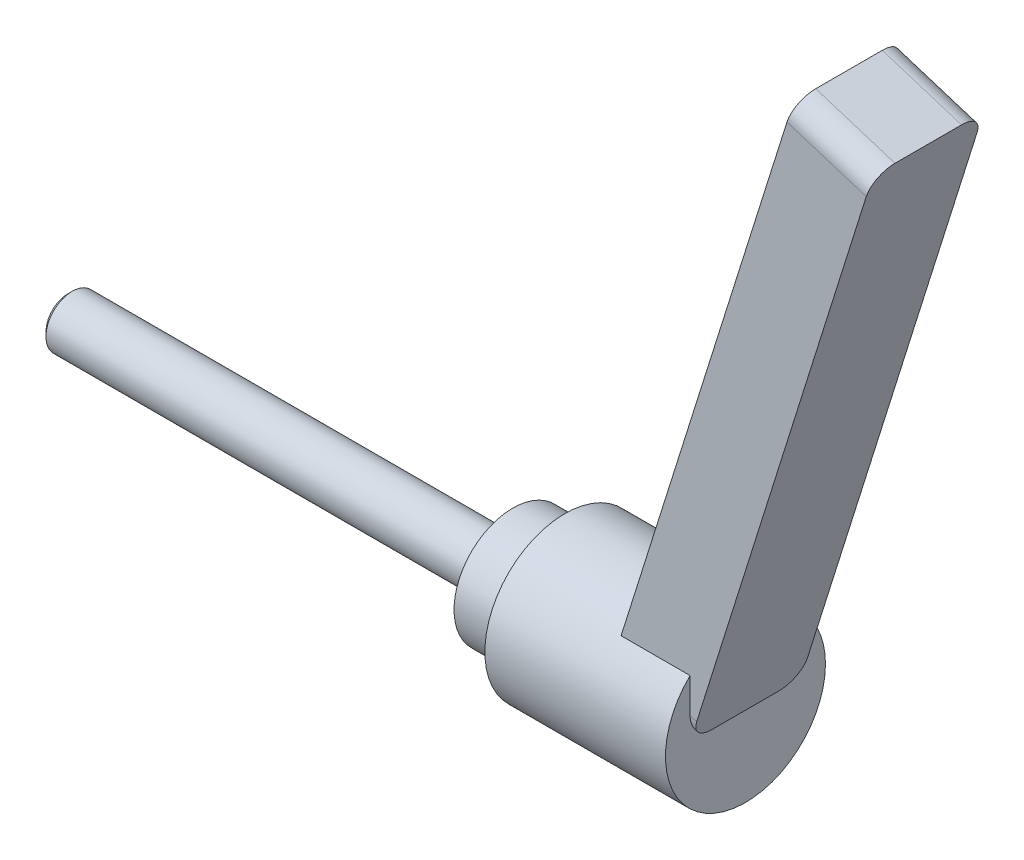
ISO-10303-21;
HEADER;
FILE_DESCRIPTION(('STEP AP214'),'2;1');
FILE_NAME('part.step','',(''),(''),'','','');
FILE_SCHEMA(('AUTOMOTIVE_DESIGN { 1 0 10303 214 1 1 1 1 }'));
ENDSEC;
DATA;
#1=APPLICATION_CONTEXT('core data for automotive mechanical design processes');
#2=APPLICATION_PROTOCOL_DEFINITION('international standard','automotive_design',2000,#1);
#3=PRODUCT_CONTEXT('',#1,'mechanical');
#4=PRODUCT('Part','Part','',(#3));
#5=PRODUCT_RELATED_PRODUCT_CATEGORY('part','',(#4));
#6=PRODUCT_DEFINITION_FORMATION('','',#4);
#7=PRODUCT_DEFINITION_CONTEXT('part definition',#1,'design');
#8=PRODUCT_DEFINITION('design','',#6,#7);
#9=PRODUCT_DEFINITION_SHAPE('','',#8);
#10=(LENGTH_UNIT() NAMED_UNIT(*) SI_UNIT(.MILLI.,.METRE.));
#11=(NAMED_UNIT(*) PLANE_ANGLE_UNIT() SI_UNIT($,.RADIAN.));
#12=(NAMED_UNIT(*) SI_UNIT($,.STERADIAN.) SOLID_ANGLE_UNIT());
#13=UNCERTAINTY_MEASURE_WITH_UNIT(LENGTH_MEASURE(1.E-05),#10,'distance_accuracy_value','');
#14=(GEOMETRIC_REPRESENTATION_CONTEXT(3) GLOBAL_UNCERTAINTY_ASSIGNED_CONTEXT((#13)) GLOBAL_UNIT_ASSIGNED_CONTEXT((#10,
#11,#12)) REPRESENTATION_CONTEXT('',''));
#15=CARTESIAN_POINT('',(0.,0.,0.));
#16=DIRECTION('',(0.,0.,1.));
#17=DIRECTION('',(1.,0.,0.));
#18=AXIS2_PLACEMENT_3D('',#15,#16,#17);
#19=CARTESIAN_POINT('',(-51.,0.,0.));
#20=DIRECTION('',(1.,0.,0.));
#21=DIRECTION('',(0.,0.,-1.));
#22=AXIS2_PLACEMENT_3D('',#19,#20,#21);
#23=PLANE('',#22);
#24=CARTESIAN_POINT('',(-51.0000000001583,0.,0.));
#25=DIRECTION('',(1.,0.,0.));
#26=DIRECTION('',(0.,0.,-1.));
#27=AXIS2_PLACEMENT_3D('',#24,#25,#26);
#28=CIRCLE('',#27,2.50000000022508);
#29=CARTESIAN_POINT('',(-51.0000000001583,0.,-2.5000000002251));
#30=VERTEX_POINT('',#29);
#31=EDGE_CURVE('E22',#30,#30,#28,.T.);
#32=ORIENTED_EDGE('',*,*,#31,.F.);
#33=EDGE_LOOP('',(#32));
#34=FACE_BOUND('',#33,.T.);
#35=ADVANCED_FACE('F19',(#34),#23,.F.);
#36=CARTESIAN_POINT('',(-50.4999999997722,0.,0.));
#37=DIRECTION('',(1.,0.,0.));
#38=DIRECTION('',(0.,0.,-1.));
#39=AXIS2_PLACEMENT_3D('',#36,#37,#38);
#40=CONICAL_SURFACE('',#39,2.99999999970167,0.785398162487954);
#41=CARTESIAN_POINT('',(-50.5,0.,0.));
#42=DIRECTION('',(-1.,0.,0.));
#43=DIRECTION('',(0.,0.,1.));
#44=AXIS2_PLACEMENT_3D('',#41,#42,#43);
#45=CIRCLE('',#44,3.);
#46=CARTESIAN_POINT('',(-50.5,0.,2.99999999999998));
#47=VERTEX_POINT('',#46);
#48=EDGE_CURVE('E140',#47,#47,#45,.F.);
#49=ORIENTED_EDGE('',*,*,#48,.F.);
#50=EDGE_LOOP('',(#49));
#51=FACE_BOUND('',#50,.T.);
#52=ORIENTED_EDGE('',*,*,#31,.T.);
#53=EDGE_LOOP('',(#52));
#54=FACE_BOUND('',#53,.T.);
#55=ADVANCED_FACE('F235',(#51,#54),#40,.T.);
#56=CARTESIAN_POINT('',(0.,0.,0.));
#57=DIRECTION('',(-1.,0.,0.));
#58=DIRECTION('',(0.,0.,1.));
#59=AXIS2_PLACEMENT_3D('',#56,#57,#58);
#60=CYLINDRICAL_SURFACE('',#59,3.);
#61=ORIENTED_EDGE('',*,*,#48,.T.);
#62=EDGE_LOOP('',(#61));
#63=FACE_BOUND('',#62,.T.);
#64=CARTESIAN_POINT('',(0.,0.,0.));
#65=DIRECTION('',(-1.,0.,0.));
#66=DIRECTION('',(0.,0.,1.));
#67=AXIS2_PLACEMENT_3D('',#64,#65,#66);
#68=CIRCLE('',#67,3.);
#69=CARTESIAN_POINT('',(0.,0.,3.));
#70=VERTEX_POINT('',#69);
#71=EDGE_CURVE('E143',#70,#70,#68,.T.);
#72=ORIENTED_EDGE('',*,*,#71,.T.);
#73=EDGE_LOOP('',(#72));
#74=FACE_BOUND('',#73,.T.);
#75=ADVANCED_FACE('F172',(#63,#74),#60,.T.);
#76=CARTESIAN_POINT('',(0.,0.,0.));
#77=DIRECTION('',(1.,0.,0.));
#78=DIRECTION('',(0.,0.,-1.));
#79=AXIS2_PLACEMENT_3D('',#76,#77,#78);
#80=PLANE('',#79);
#81=ORIENTED_EDGE('',*,*,#71,.F.);
#82=EDGE_LOOP('',(#81));
#83=FACE_BOUND('',#82,.T.);
#84=CARTESIAN_POINT('',(0.,0.,0.));
#85=DIRECTION('',(1.,0.,0.));
#86=DIRECTION('',(0.,0.,-1.));
#87=AXIS2_PLACEMENT_3D('',#84,#85,#86);
#88=CIRCLE('',#87,6.731);
#89=CARTESIAN_POINT('',(0.,0.,-6.731));
#90=VERTEX_POINT('',#89);
#91=EDGE_CURVE('E98',#90,#90,#88,.T.);
#92=ORIENTED_EDGE('',*,*,#91,.F.);
#93=EDGE_LOOP('',(#92));
#94=FACE_BOUND('',#93,.T.);
#95=ADVANCED_FACE('F174',(#83,#94),#80,.F.);
#96=CARTESIAN_POINT('',(0.,0.,0.));
#97=DIRECTION('',(1.,0.,0.));
#98=DIRECTION('',(0.,0.,-1.));
#99=AXIS2_PLACEMENT_3D('',#96,#97,#98);
#100=CYLINDRICAL_SURFACE('',#99,6.731);
#101=ORIENTED_EDGE('',*,*,#91,.T.);
#102=EDGE_LOOP('',(#101));
#103=FACE_BOUND('',#102,.T.);
#104=CARTESIAN_POINT('',(5.96899999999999,0.,0.));
#105=DIRECTION('',(1.,0.,0.));
#106=DIRECTION('',(0.,0.,-1.));
#107=AXIS2_PLACEMENT_3D('',#104,#105,#106);
#108=CIRCLE('',#107,6.731);
#109=CARTESIAN_POINT('',(5.96899999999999,0.,-6.73099999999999));
#110=VERTEX_POINT('',#109);
#111=EDGE_CURVE('E116',#110,#110,#108,.F.);
#112=ORIENTED_EDGE('',*,*,#111,.T.);
#113=EDGE_LOOP('',(#112));
#114=FACE_BOUND('',#113,.T.);
#115=ADVANCED_FACE('F177',(#103,#114),#100,.T.);
#116=CARTESIAN_POINT('',(47.6250000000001,66.6750000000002,-3.80999999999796));
#117=DIRECTION('',(0.299826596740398,0.953993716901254,0.));
#118=DIRECTION('',(-0.953993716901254,0.299826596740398,0.));
#119=AXIS2_PLACEMENT_3D('',#116,#117,#118);
#120=PLANE('',#119);
#121=DIRECTION('',(0.,0.,1.));
#122=VECTOR('',#121,1.);
#123=CARTESIAN_POINT('',(47.6250000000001,66.6750000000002,0.));
#124=LINE('',#123,#122);
#125=CARTESIAN_POINT('',(47.6250000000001,66.6750000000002,-3.80999999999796));
#126=VERTEX_POINT('',#125);
#127=CARTESIAN_POINT('',(47.6250000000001,66.6750000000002,3.80999999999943));
#128=VERTEX_POINT('',#127);
#129=EDGE_CURVE('E91',#126,#128,#124,.T.);
#130=ORIENTED_EDGE('',*,*,#129,.F.);
#131=DIRECTION('',(-0.953993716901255,0.299826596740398,0.));
#132=VECTOR('',#131,1.);
#133=CARTESIAN_POINT('',(47.6250000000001,66.6750000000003,-3.80999999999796));
#134=LINE('',#133,#132);
#135=CARTESIAN_POINT('',(38.5382098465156,69.5308483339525,-3.80999999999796));
#136=VERTEX_POINT('',#135);
#137=EDGE_CURVE('E97',#136,#126,#134,.F.);
#138=ORIENTED_EDGE('',*,*,#137,.F.);
#139=DIRECTION('',(0.,0.,1.));
#140=VECTOR('',#139,1.);
#141=CARTESIAN_POINT('',(38.5382098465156,69.5308483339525,6.35000000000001));
#142=LINE('',#141,#140);
#143=CARTESIAN_POINT('',(38.5382098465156,69.5308483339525,3.80999999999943));
#144=VERTEX_POINT('',#143);
#145=EDGE_CURVE('E94',#136,#144,#142,.T.);
#146=ORIENTED_EDGE('',*,*,#145,.T.);
#147=DIRECTION('',(-0.953993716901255,0.299826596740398,0.));
#148=VECTOR('',#147,1.);
#149=CARTESIAN_POINT('',(47.625,66.6750000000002,3.80999999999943));
#150=LINE('',#149,#148);
#151=EDGE_CURVE('E87',#128,#144,#150,.T.);
#152=ORIENTED_EDGE('',*,*,#151,.F.);
#153=EDGE_LOOP('',(#130,#138,#146,#152));
#154=FACE_BOUND('',#153,.T.);
#155=ADVANCED_FACE('F89',(#154),#120,.T.);
#156=CARTESIAN_POINT('',(46.8634404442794,64.251855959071,3.80999999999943));
#157=DIRECTION('',(-0.953993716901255,0.299826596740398,0.));
#158=DIRECTION('',(-0.299826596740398,-0.953993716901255,0.));
#159=AXIS2_PLACEMENT_3D('',#156,#157,#158);
#160=CYLINDRICAL_SURFACE('',#159,2.54);
#161=CARTESIAN_POINT('',(46.8634404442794,64.251855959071,3.80999999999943));
#162=DIRECTION('',(-0.953993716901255,0.299826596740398,0.));
#163=DIRECTION('',(-0.299826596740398,-0.953993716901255,0.));
#164=AXIS2_PLACEMENT_3D('',#161,#162,#163);
#165=CIRCLE('',#164,2.54);
#166=CARTESIAN_POINT('',(46.8634404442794,64.251855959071,6.35000000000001));
#167=VERTEX_POINT('',#166);
#168=EDGE_CURVE('E102',#128,#167,#165,.F.);
#169=ORIENTED_EDGE('',*,*,#168,.F.);
#170=ORIENTED_EDGE('',*,*,#151,.T.);
#171=CARTESIAN_POINT('',(37.776650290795,67.1077042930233,3.80999999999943));
#172=DIRECTION('',(-0.953993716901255,0.299826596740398,0.));
#173=DIRECTION('',(-0.299826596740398,-0.953993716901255,0.));
#174=AXIS2_PLACEMENT_3D('',#171,#172,#173);
#175=CIRCLE('',#174,2.54);
#176=CARTESIAN_POINT('',(37.776650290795,67.1077042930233,6.35000000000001));
#177=VERTEX_POINT('',#176);
#178=EDGE_CURVE('E160',#144,#177,#175,.F.);
#179=ORIENTED_EDGE('',*,*,#178,.T.);
#180=DIRECTION('',(-0.953993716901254,0.299826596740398,0.));
#181=VECTOR('',#180,1.);
#182=CARTESIAN_POINT('',(46.8634404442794,64.251855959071,6.35000000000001));
#183=LINE('',#182,#181);
#184=EDGE_CURVE('E105',#167,#177,#183,.T.);
#185=ORIENTED_EDGE('',*,*,#184,.F.);
#186=EDGE_LOOP('',(#169,#170,#179,#185));
#187=FACE_BOUND('',#186,.T.);
#188=ADVANCED_FACE('F103',(#187),#160,.T.);
#189=CARTESIAN_POINT('',(46.8634404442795,64.2518559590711,-3.80999999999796));
#190=DIRECTION('',(-0.953993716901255,0.299826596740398,0.));
#191=DIRECTION('',(-0.299826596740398,-0.953993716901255,0.));
#192=AXIS2_PLACEMENT_3D('',#189,#190,#191);
#193=CYLINDRICAL_SURFACE('',#192,2.54);
#194=CARTESIAN_POINT('',(46.8634404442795,64.2518559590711,-3.80999999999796));
#195=DIRECTION('',(-0.953993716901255,0.299826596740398,0.));
#196=DIRECTION('',(-0.299826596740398,-0.953993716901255,0.));
#197=AXIS2_PLACEMENT_3D('',#194,#195,#196);
#198=CIRCLE('',#197,2.54);
#199=CARTESIAN_POINT('',(46.8634404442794,64.251855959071,-6.34999999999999));
#200=VERTEX_POINT('',#199);
#201=EDGE_CURVE('E113',#200,#126,#198,.F.);
#202=ORIENTED_EDGE('',*,*,#201,.F.);
#203=DIRECTION('',(0.953993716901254,-0.299826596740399,0.));
#204=VECTOR('',#203,1.);
#205=CARTESIAN_POINT('',(37.7766502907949,67.1077042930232,-6.34999999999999));
#206=LINE('',#205,#204);
#207=CARTESIAN_POINT('',(37.776650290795,67.1077042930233,-6.34999999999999));
#208=VERTEX_POINT('',#207);
#209=EDGE_CURVE('E132',#208,#200,#206,.T.);
#210=ORIENTED_EDGE('',*,*,#209,.F.);
#211=CARTESIAN_POINT('',(37.776650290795,67.1077042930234,-3.80999999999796));
#212=DIRECTION('',(-0.953993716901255,0.299826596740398,0.));
#213=DIRECTION('',(-0.299826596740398,-0.953993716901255,0.));
#214=AXIS2_PLACEMENT_3D('',#211,#212,#213);
#215=CIRCLE('',#214,2.54);
#216=EDGE_CURVE('E136',#208,#136,#215,.F.);
#217=ORIENTED_EDGE('',*,*,#216,.T.);
#218=ORIENTED_EDGE('',*,*,#137,.T.);
#219=EDGE_LOOP('',(#202,#210,#217,#218));
#220=FACE_BOUND('',#219,.T.);
#221=ADVANCED_FACE('F225',(#220),#193,.T.);
#222=CARTESIAN_POINT('',(27.4315595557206,2.42314404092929,-3.80999999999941));
#223=DIRECTION('',(-0.953993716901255,0.299826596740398,0.));
#224=DIRECTION('',(-0.299826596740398,-0.953993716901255,0.));
#225=AXIS2_PLACEMENT_3D('',#222,#223,#224);
#226=CYLINDRICAL_SURFACE('',#225,2.54);
#227=DIRECTION('',(-0.953993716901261,0.299826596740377,0.));
#228=VECTOR('',#227,1.);
#229=CARTESIAN_POINT('',(27.4315595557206,2.42314404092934,-6.34999999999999));
#230=LINE('',#229,#228);
#231=CARTESIAN_POINT('',(27.4315595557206,2.42314404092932,-6.34999999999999));
#232=VERTEX_POINT('',#231);
#233=CARTESIAN_POINT('',(26.67,2.66249132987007,-6.3499999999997));
#234=VERTEX_POINT('',#233);
#235=EDGE_CURVE('E122',#232,#234,#230,.T.);
#236=ORIENTED_EDGE('',*,*,#235,.F.);
#237=CARTESIAN_POINT('',(27.4315595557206,2.42314404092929,-3.80999999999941));
#238=DIRECTION('',(-0.953993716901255,0.299826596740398,0.));
#239=DIRECTION('',(-0.299826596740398,-0.953993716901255,0.));
#240=AXIS2_PLACEMENT_3D('',#237,#238,#239);
#241=CIRCLE('',#240,2.54);
#242=CARTESIAN_POINT('',(26.67,0.,-3.80999999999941));
#243=VERTEX_POINT('',#242);
#244=EDGE_CURVE('E109',#243,#232,#241,.F.);
#245=ORIENTED_EDGE('',*,*,#244,.F.);
#246=CARTESIAN_POINT('',(26.67,2.66249132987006,-3.80999999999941));
#247=DIRECTION('',(1.,0.,0.));
#248=DIRECTION('',(0.,1.,0.));
#249=AXIS2_PLACEMENT_3D('',#246,#247,#248);
#250=ELLIPSE('',#249,2.66249132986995,2.54);
#251=EDGE_CURVE('E157',#234,#243,#250,.F.);
#252=ORIENTED_EDGE('',*,*,#251,.F.);
#253=EDGE_LOOP('',(#236,#245,#252));
#254=FACE_BOUND('',#253,.T.);
#255=ADVANCED_FACE('F222',(#254),#226,.T.);
#256=CARTESIAN_POINT('',(37.1475,33.3375000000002,0.));
#257=DIRECTION('',(0.953993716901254,-0.299826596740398,0.));
#258=DIRECTION('',(0.299826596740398,0.953993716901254,0.));
#259=AXIS2_PLACEMENT_3D('',#256,#257,#258);
#260=PLANE('',#259);
#261=ORIENTED_EDGE('',*,*,#201,.T.);
#262=ORIENTED_EDGE('',*,*,#129,.T.);
#263=ORIENTED_EDGE('',*,*,#168,.T.);
#264=DIRECTION('',(0.299826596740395,0.953993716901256,0.));
#265=VECTOR('',#264,1.);
#266=CARTESIAN_POINT('',(27.4315595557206,2.42314404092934,6.35000000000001));
#267=LINE('',#266,#265);
#268=CARTESIAN_POINT('',(27.4315595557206,2.42314404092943,6.35000000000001));
#269=VERTEX_POINT('',#268);
#270=EDGE_CURVE('E129',#269,#167,#267,.T.);
#271=ORIENTED_EDGE('',*,*,#270,.F.);
#272=CARTESIAN_POINT('',(27.4315595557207,2.42314404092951,3.80999999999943));
#273=DIRECTION('',(-0.953993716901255,0.299826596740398,0.));
#274=DIRECTION('',(-0.299826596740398,-0.953993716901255,0.));
#275=AXIS2_PLACEMENT_3D('',#272,#273,#274);
#276=CIRCLE('',#275,2.54);
#277=CARTESIAN_POINT('',(26.67,2.19659360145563E-13,3.80999999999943));
#278=VERTEX_POINT('',#277);
#279=EDGE_CURVE('E114',#278,#269,#276,.T.);
#280=ORIENTED_EDGE('',*,*,#279,.F.);
#281=DIRECTION('',(0.,0.,-1.));
#282=VECTOR('',#281,1.);
#283=CARTESIAN_POINT('',(26.67,0.,0.));
#284=LINE('',#283,#282);
#285=EDGE_CURVE('E156',#243,#278,#284,.F.);
#286=ORIENTED_EDGE('',*,*,#285,.F.);
#287=ORIENTED_EDGE('',*,*,#244,.T.);
#288=DIRECTION('',(-0.299826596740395,-0.953993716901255,0.));
#289=VECTOR('',#288,1.);
#290=CARTESIAN_POINT('',(46.8634404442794,64.2518559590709,-6.34999999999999));
#291=LINE('',#290,#289);
#292=EDGE_CURVE('E125',#200,#232,#291,.T.);
#293=ORIENTED_EDGE('',*,*,#292,.F.);
#294=EDGE_LOOP('',(#261,#262,#263,#271,#280,#286,#287,#293));
#295=FACE_BOUND('',#294,.T.);
#296=ADVANCED_FACE('F111',(#295),#260,.T.);
#297=CARTESIAN_POINT('',(27.4315595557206,2.42314404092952,3.80999999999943));
#298=DIRECTION('',(-0.953993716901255,0.299826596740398,0.));
#299=DIRECTION('',(-0.299826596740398,-0.953993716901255,0.));
#300=AXIS2_PLACEMENT_3D('',#297,#298,#299);
#301=CYLINDRICAL_SURFACE('',#300,2.54);
#302=ORIENTED_EDGE('',*,*,#279,.T.);
#303=DIRECTION('',(0.953993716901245,-0.299826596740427,0.));
#304=VECTOR('',#303,1.);
#305=CARTESIAN_POINT('',(26.67,2.66249132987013,6.35000000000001));
#306=LINE('',#305,#304);
#307=CARTESIAN_POINT('',(26.67,2.66249132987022,6.34999999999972));
#308=VERTEX_POINT('',#307);
#309=EDGE_CURVE('E126',#308,#269,#306,.T.);
#310=ORIENTED_EDGE('',*,*,#309,.F.);
#311=CARTESIAN_POINT('',(26.67,2.6624913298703,3.80999999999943));
#312=DIRECTION('',(1.,0.,0.));
#313=DIRECTION('',(0.,1.,0.));
#314=AXIS2_PLACEMENT_3D('',#311,#312,#313);
#315=ELLIPSE('',#314,2.66249132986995,2.54);
#316=EDGE_CURVE('E153',#278,#308,#315,.F.);
#317=ORIENTED_EDGE('',*,*,#316,.F.);
#318=EDGE_LOOP('',(#302,#310,#317));
#319=FACE_BOUND('',#318,.T.);
#320=ADVANCED_FACE('F190',(#319),#301,.T.);
#321=CARTESIAN_POINT('',(5.96899999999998,0.,0.));
#322=DIRECTION('',(1.,0.,0.));
#323=DIRECTION('',(0.,0.,-1.));
#324=AXIS2_PLACEMENT_3D('',#321,#322,#323);
#325=PLANE('',#324);
#326=ORIENTED_EDGE('',*,*,#111,.F.);
#327=EDGE_LOOP('',(#326));
#328=FACE_BOUND('',#327,.T.);
#329=CARTESIAN_POINT('',(5.96899999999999,0.,0.));
#330=DIRECTION('',(1.,0.,0.));
#331=DIRECTION('',(0.,0.,-1.));
#332=AXIS2_PLACEMENT_3D('',#329,#330,#331);
#333=CIRCLE('',#332,9.16939999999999);
#334=CARTESIAN_POINT('',(5.96899999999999,0.,-9.16939999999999));
#335=VERTEX_POINT('',#334);
#336=EDGE_CURVE('E150',#335,#335,#333,.T.);
#337=ORIENTED_EDGE('',*,*,#336,.F.);
#338=EDGE_LOOP('',(#337));
#339=FACE_BOUND('',#338,.T.);
#340=ADVANCED_FACE('F186',(#328,#339),#325,.F.);
#341=CARTESIAN_POINT('',(46.8634404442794,64.251855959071,6.35000000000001));
#342=DIRECTION('',(0.,0.,1.));
#343=DIRECTION('',(1.,0.,0.));
#344=AXIS2_PLACEMENT_3D('',#341,#342,#343);
#345=PLANE('',#344);
#346=DIRECTION('',(0.299826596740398,0.953993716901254,0.));
#347=VECTOR('',#346,1.);
#348=CARTESIAN_POINT('',(37.776650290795,67.1077042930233,6.35000000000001));
#349=LINE('',#348,#347);
#350=CARTESIAN_POINT('',(18.7645903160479,6.614786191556,6.35));
#351=VERTEX_POINT('',#350);
#352=EDGE_CURVE('E162',#177,#351,#349,.F.);
#353=ORIENTED_EDGE('',*,*,#352,.T.);
#354=DIRECTION('',(1.,0.,0.));
#355=VECTOR('',#354,1.);
#356=CARTESIAN_POINT('',(5.96899999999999,6.61478619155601,6.34999999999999));
#357=LINE('',#356,#355);
#358=CARTESIAN_POINT('',(26.67,6.614786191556,6.35));
#359=VERTEX_POINT('',#358);
#360=EDGE_CURVE('E149',#359,#351,#357,.F.);
#361=ORIENTED_EDGE('',*,*,#360,.F.);
#362=DIRECTION('',(0.,1.,0.));
#363=VECTOR('',#362,1.);
#364=CARTESIAN_POINT('',(26.67,9.16940000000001,6.35));
#365=LINE('',#364,#363);
#366=EDGE_CURVE('E124',#308,#359,#365,.T.);
#367=ORIENTED_EDGE('',*,*,#366,.F.);
#368=ORIENTED_EDGE('',*,*,#309,.T.);
#369=ORIENTED_EDGE('',*,*,#270,.T.);
#370=ORIENTED_EDGE('',*,*,#184,.T.);
#371=EDGE_LOOP('',(#353,#361,#367,#368,#369,#370));
#372=FACE_BOUND('',#371,.T.);
#373=ADVANCED_FACE('F189',(#372),#345,.T.);
#374=CARTESIAN_POINT('',(37.776650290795,67.1077042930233,6.35000000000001));
#375=DIRECTION('',(0.953993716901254,-0.299826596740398,0.));
#376=DIRECTION('',(0.299826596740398,0.953993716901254,0.));
#377=AXIS2_PLACEMENT_3D('',#374,#375,#376);
#378=PLANE('',#377);
#379=ORIENTED_EDGE('',*,*,#352,.F.);
#380=ORIENTED_EDGE('',*,*,#178,.F.);
#381=ORIENTED_EDGE('',*,*,#145,.F.);
#382=ORIENTED_EDGE('',*,*,#216,.F.);
#383=DIRECTION('',(0.299826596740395,0.953993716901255,0.));
#384=VECTOR('',#383,1.);
#385=CARTESIAN_POINT('',(18.7645903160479,6.61478619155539,-6.34999999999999));
#386=LINE('',#385,#384);
#387=CARTESIAN_POINT('',(18.7645903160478,6.61478619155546,-6.35000000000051));
#388=VERTEX_POINT('',#387);
#389=EDGE_CURVE('E135',#388,#208,#386,.T.);
#390=ORIENTED_EDGE('',*,*,#389,.F.);
#391=CARTESIAN_POINT('',(16.6856575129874,0.,0.));
#392=DIRECTION('',(0.953993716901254,-0.299826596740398,0.));
#393=DIRECTION('',(0.299826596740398,0.953993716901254,0.));
#394=AXIS2_PLACEMENT_3D('',#391,#392,#393);
#395=ELLIPSE('',#394,9.61159370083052,9.16939999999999);
#396=EDGE_CURVE('E146',#351,#388,#395,.F.);
#397=ORIENTED_EDGE('',*,*,#396,.F.);
#398=EDGE_LOOP('',(#379,#380,#381,#382,#390,#397));
#399=FACE_BOUND('',#398,.T.);
#400=ADVANCED_FACE('F210',(#399),#378,.F.);
#401=CARTESIAN_POINT('',(27.4315595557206,2.42314404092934,-6.34999999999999));
#402=DIRECTION('',(0.,0.,-1.));
#403=DIRECTION('',(-1.,0.,0.));
#404=AXIS2_PLACEMENT_3D('',#401,#402,#403);
#405=PLANE('',#404);
#406=ORIENTED_EDGE('',*,*,#292,.T.);
#407=ORIENTED_EDGE('',*,*,#235,.T.);
#408=DIRECTION('',(0.,1.,0.));
#409=VECTOR('',#408,1.);
#410=CARTESIAN_POINT('',(26.67,9.16940000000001,-6.34999999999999));
#411=LINE('',#410,#409);
#412=CARTESIAN_POINT('',(26.67,6.61478619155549,-6.35000000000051));
#413=VERTEX_POINT('',#412);
#414=EDGE_CURVE('E37',#413,#234,#411,.F.);
#415=ORIENTED_EDGE('',*,*,#414,.F.);
#416=DIRECTION('',(1.,0.,0.));
#417=VECTOR('',#416,1.);
#418=CARTESIAN_POINT('',(5.96899999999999,6.61478619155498,-6.35000000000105));
#419=LINE('',#418,#417);
#420=EDGE_CURVE('E28',#388,#413,#419,.T.);
#421=ORIENTED_EDGE('',*,*,#420,.F.);
#422=ORIENTED_EDGE('',*,*,#389,.T.);
#423=ORIENTED_EDGE('',*,*,#209,.T.);
#424=EDGE_LOOP('',(#406,#407,#415,#421,#422,#423));
#425=FACE_BOUND('',#424,.T.);
#426=ADVANCED_FACE('F203',(#425),#405,.T.);
#427=CARTESIAN_POINT('',(26.67,9.16940000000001,0.));
#428=DIRECTION('',(1.,0.,0.));
#429=DIRECTION('',(0.,0.,-1.));
#430=AXIS2_PLACEMENT_3D('',#427,#428,#429);
#431=PLANE('',#430);
#432=ORIENTED_EDGE('',*,*,#285,.T.);
#433=ORIENTED_EDGE('',*,*,#316,.T.);
#434=ORIENTED_EDGE('',*,*,#366,.T.);
#435=CARTESIAN_POINT('',(26.67,0.,0.));
#436=DIRECTION('',(1.,0.,0.));
#437=DIRECTION('',(0.,0.,-1.));
#438=AXIS2_PLACEMENT_3D('',#435,#436,#437);
#439=CIRCLE('',#438,9.16939999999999);
#440=EDGE_CURVE('E11',#413,#359,#439,.F.);
#441=ORIENTED_EDGE('',*,*,#440,.F.);
#442=ORIENTED_EDGE('',*,*,#414,.T.);
#443=ORIENTED_EDGE('',*,*,#251,.T.);
#444=EDGE_LOOP('',(#432,#433,#434,#441,#442,#443));
#445=FACE_BOUND('',#444,.T.);
#446=ADVANCED_FACE('F196',(#445),#431,.T.);
#447=CARTESIAN_POINT('',(5.96899999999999,0.,0.));
#448=DIRECTION('',(1.,0.,0.));
#449=DIRECTION('',(0.,0.,-1.));
#450=AXIS2_PLACEMENT_3D('',#447,#448,#449);
#451=CYLINDRICAL_SURFACE('',#450,9.16939999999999);
#452=ORIENTED_EDGE('',*,*,#420,.T.);
#453=ORIENTED_EDGE('',*,*,#440,.T.);
#454=ORIENTED_EDGE('',*,*,#360,.T.);
#455=ORIENTED_EDGE('',*,*,#396,.T.);
#456=EDGE_LOOP('',(#452,#453,#454,#455));
#457=FACE_BOUND('',#456,.T.);
#458=ORIENTED_EDGE('',*,*,#336,.T.);
#459=EDGE_LOOP('',(#458));
#460=FACE_BOUND('',#459,.T.);
#461=ADVANCED_FACE('F194',(#457,#460),#451,.T.);
#462=CLOSED_SHELL('',(#35,#55,#75,#95,#115,#155,#188,#221,#255,#296,#320,#340,#373,#400,#426,
#446,#461));
#463=MANIFOLD_SOLID_BREP('B1',#462);
#464=ADVANCED_BREP_SHAPE_REPRESENTATION('',(#18,#463),#14);
#465=SHAPE_DEFINITION_REPRESENTATION(#9,#464);
ENDSEC;
END-ISO-10303-21;
